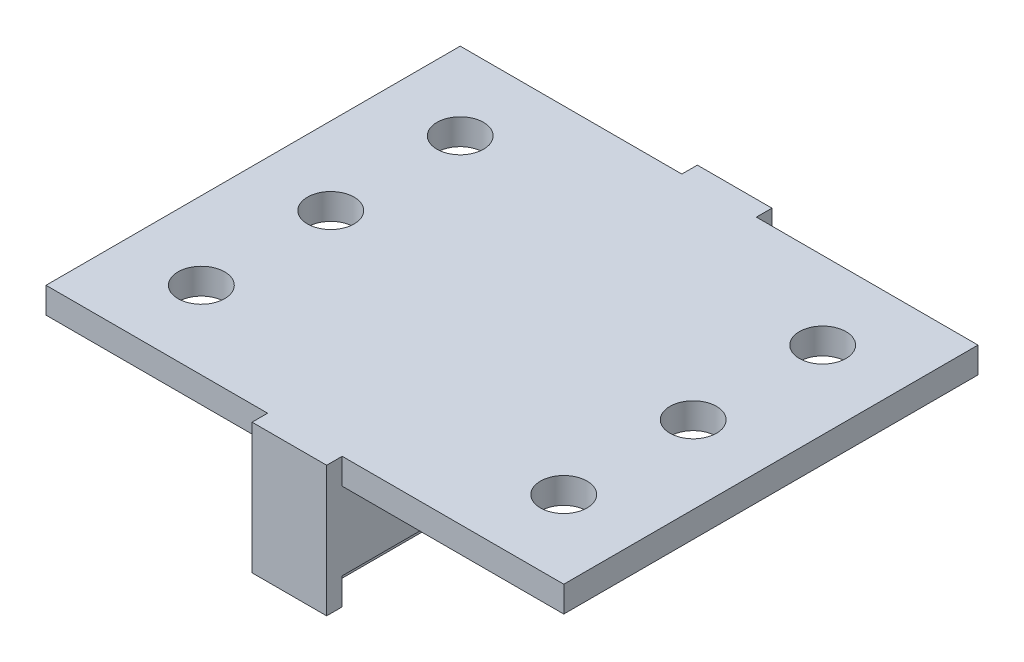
from build123d import *

# Parameters (mm, degrees)
BOSS_EXTRUDE1_DEPTH    = 80
M10X1_0_TAPPED_HOLE1_D = 9
SKETCH4_W              = 14.4
SKETCH4_H              = 25.2
BOSS_EXTRUDE2_DEPTH    = 3


with BuildPart() as part:
    # Sketch1 → Boss-Extrude1 (new body)
    with BuildSketch(Plane.XY):
        Polygon((52.4, 20.812623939), (47.6, 20.812623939), (47.6, 26.012623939), (42.8, 26.012623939), (42.8, 41.012623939), (0, 41.012623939), (0, 46.012623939), (100, 46.012623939), (100, 41.012623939), (57.2, 41.012623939), (57.2, 26.012623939), (52.4, 26.012623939), align=None)
    extrude(amount=BOSS_EXTRUDE1_DEPTH)

    # M10x1.0 Tapped Hole1 (through all)
    with Locations(Plane(origin=(0, 46.012623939, 0), x_dir=(1, 0, 0), z_dir=(0, 1, 0))):
        with Locations((15, -65), (15, -40), (15, -15), (85, -15), (85, -40), (85, -65)):
            Hole(M10X1_0_TAPPED_HOLE1_D / 2)

    # Sketch4 → Boss-Extrude2 (add)
    with BuildSketch(Plane.XY.offset(80)):
        with Locations((50, 33.412623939)):
            Rectangle(SKETCH4_W, SKETCH4_H)
    boss_extrude2 = extrude(amount=BOSS_EXTRUDE2_DEPTH)

    # Mirror1: Boss-Extrude2 across plane
    add(boss_extrude2.mirror(Plane.XY.offset(40)))


solid = part.part
